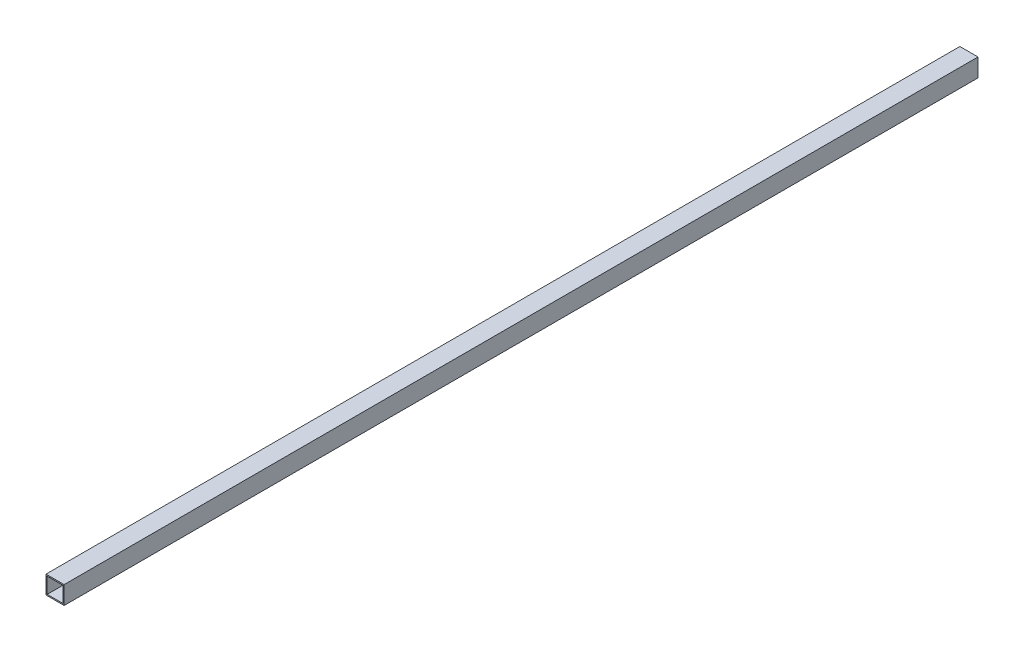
ISO-10303-21;
HEADER;
FILE_DESCRIPTION(('STEP AP214'),'2;1');
FILE_NAME('part.step','',(''),(''),'','','');
FILE_SCHEMA(('AUTOMOTIVE_DESIGN { 1 0 10303 214 1 1 1 1 }'));
ENDSEC;
DATA;
#1=APPLICATION_CONTEXT('core data for automotive mechanical design processes');
#2=APPLICATION_PROTOCOL_DEFINITION('international standard','automotive_design',2000,#1);
#3=PRODUCT_CONTEXT('',#1,'mechanical');
#4=PRODUCT('Part','Part','',(#3));
#5=PRODUCT_RELATED_PRODUCT_CATEGORY('part','',(#4));
#6=PRODUCT_DEFINITION_FORMATION('','',#4);
#7=PRODUCT_DEFINITION_CONTEXT('part definition',#1,'design');
#8=PRODUCT_DEFINITION('design','',#6,#7);
#9=PRODUCT_DEFINITION_SHAPE('','',#8);
#10=(LENGTH_UNIT() NAMED_UNIT(*) SI_UNIT(.MILLI.,.METRE.));
#11=(NAMED_UNIT(*) PLANE_ANGLE_UNIT() SI_UNIT($,.RADIAN.));
#12=(NAMED_UNIT(*) SI_UNIT($,.STERADIAN.) SOLID_ANGLE_UNIT());
#13=UNCERTAINTY_MEASURE_WITH_UNIT(LENGTH_MEASURE(1.E-05),#10,'distance_accuracy_value','');
#14=(GEOMETRIC_REPRESENTATION_CONTEXT(3) GLOBAL_UNCERTAINTY_ASSIGNED_CONTEXT((#13)) GLOBAL_UNIT_ASSIGNED_CONTEXT((#10,
#11,#12)) REPRESENTATION_CONTEXT('',''));
#15=CARTESIAN_POINT('',(0.,0.,0.));
#16=DIRECTION('',(0.,0.,1.));
#17=DIRECTION('',(1.,0.,0.));
#18=AXIS2_PLACEMENT_3D('',#15,#16,#17);
#19=CARTESIAN_POINT('',(-26.,26.,0.));
#20=DIRECTION('',(1.,0.,0.));
#21=DIRECTION('',(0.,1.,0.));
#22=AXIS2_PLACEMENT_3D('',#19,#20,#21);
#23=PLANE('',#22);
#24=DIRECTION('',(0.,-1.,0.));
#25=VECTOR('',#24,1.);
#26=CARTESIAN_POINT('',(-26.,2.5,14.));
#27=LINE('',#26,#25);
#28=CARTESIAN_POINT('',(-26.,26.,14.));
#29=VERTEX_POINT('',#28);
#30=CARTESIAN_POINT('',(-26.,-26.,14.));
#31=VERTEX_POINT('',#30);
#32=EDGE_CURVE('E113',#29,#31,#27,.T.);
#33=ORIENTED_EDGE('',*,*,#32,.F.);
#34=DIRECTION('',(0.,0.,1.));
#35=VECTOR('',#34,1.);
#36=CARTESIAN_POINT('',(-26.,26.,0.));
#37=LINE('',#36,#35);
#38=CARTESIAN_POINT('',(-26.,26.,3036.));
#39=VERTEX_POINT('',#38);
#40=EDGE_CURVE('E10',#29,#39,#37,.T.);
#41=ORIENTED_EDGE('',*,*,#40,.T.);
#42=DIRECTION('',(0.,1.,0.));
#43=VECTOR('',#42,1.);
#44=CARTESIAN_POINT('',(-26.,-33.,3036.));
#45=LINE('',#44,#43);
#46=CARTESIAN_POINT('',(-26.,-26.,3036.));
#47=VERTEX_POINT('',#46);
#48=EDGE_CURVE('E111',#47,#39,#45,.T.);
#49=ORIENTED_EDGE('',*,*,#48,.F.);
#50=DIRECTION('',(0.,0.,1.));
#51=VECTOR('',#50,1.);
#52=CARTESIAN_POINT('',(-26.,-26.,0.));
#53=LINE('',#52,#51);
#54=EDGE_CURVE('E78',#31,#47,#53,.T.);
#55=ORIENTED_EDGE('',*,*,#54,.F.);
#56=EDGE_LOOP('',(#33,#41,#49,#55));
#57=FACE_BOUND('',#56,.T.);
#58=ADVANCED_FACE('F16',(#57),#23,.T.);
#59=CARTESIAN_POINT('',(26.,26.,0.));
#60=DIRECTION('',(0.,-1.,0.));
#61=DIRECTION('',(0.,0.,-1.));
#62=AXIS2_PLACEMENT_3D('',#59,#60,#61);
#63=PLANE('',#62);
#64=DIRECTION('',(-1.,0.,0.));
#65=VECTOR('',#64,1.);
#66=CARTESIAN_POINT('',(13.,26.,14.));
#67=LINE('',#66,#65);
#68=CARTESIAN_POINT('',(26.,26.,14.));
#69=VERTEX_POINT('',#68);
#70=EDGE_CURVE('E163',#69,#29,#67,.T.);
#71=ORIENTED_EDGE('',*,*,#70,.F.);
#72=DIRECTION('',(0.,0.,1.));
#73=VECTOR('',#72,1.);
#74=CARTESIAN_POINT('',(26.,26.,0.));
#75=LINE('',#74,#73);
#76=CARTESIAN_POINT('',(26.,26.,3036.));
#77=VERTEX_POINT('',#76);
#78=EDGE_CURVE('E25',#69,#77,#75,.T.);
#79=ORIENTED_EDGE('',*,*,#78,.T.);
#80=DIRECTION('',(1.,0.,0.));
#81=VECTOR('',#80,1.);
#82=CARTESIAN_POINT('',(13.,26.,3036.));
#83=LINE('',#82,#81);
#84=EDGE_CURVE('E118',#39,#77,#83,.T.);
#85=ORIENTED_EDGE('',*,*,#84,.F.);
#86=ORIENTED_EDGE('',*,*,#40,.F.);
#87=EDGE_LOOP('',(#71,#79,#85,#86));
#88=FACE_BOUND('',#87,.T.);
#89=ADVANCED_FACE('F119',(#88),#63,.T.);
#90=CARTESIAN_POINT('',(26.,-26.,0.));
#91=DIRECTION('',(-1.,0.,0.));
#92=DIRECTION('',(0.,0.,1.));
#93=AXIS2_PLACEMENT_3D('',#90,#91,#92);
#94=PLANE('',#93);
#95=DIRECTION('',(0.,1.,0.));
#96=VECTOR('',#95,1.);
#97=CARTESIAN_POINT('',(26.,-23.5,14.));
#98=LINE('',#97,#96);
#99=CARTESIAN_POINT('',(26.,-26.,14.));
#100=VERTEX_POINT('',#99);
#101=EDGE_CURVE('E158',#100,#69,#98,.T.);
#102=ORIENTED_EDGE('',*,*,#101,.F.);
#103=DIRECTION('',(0.,0.,1.));
#104=VECTOR('',#103,1.);
#105=CARTESIAN_POINT('',(26.,-26.,0.));
#106=LINE('',#105,#104);
#107=CARTESIAN_POINT('',(26.,-26.,3036.));
#108=VERTEX_POINT('',#107);
#109=EDGE_CURVE('E38',#100,#108,#106,.T.);
#110=ORIENTED_EDGE('',*,*,#109,.T.);
#111=DIRECTION('',(0.,-1.,0.));
#112=VECTOR('',#111,1.);
#113=CARTESIAN_POINT('',(26.,-59.,3036.));
#114=LINE('',#113,#112);
#115=EDGE_CURVE('E123',#77,#108,#114,.T.);
#116=ORIENTED_EDGE('',*,*,#115,.F.);
#117=ORIENTED_EDGE('',*,*,#78,.F.);
#118=EDGE_LOOP('',(#102,#110,#116,#117));
#119=FACE_BOUND('',#118,.T.);
#120=ADVANCED_FACE('F230',(#119),#94,.T.);
#121=CARTESIAN_POINT('',(-26.,-26.,0.));
#122=DIRECTION('',(0.,1.,0.));
#123=DIRECTION('',(1.,0.,0.));
#124=AXIS2_PLACEMENT_3D('',#121,#122,#123);
#125=PLANE('',#124);
#126=DIRECTION('',(1.,0.,0.));
#127=VECTOR('',#126,1.);
#128=CARTESIAN_POINT('',(-13.,-26.,14.));
#129=LINE('',#128,#127);
#130=EDGE_CURVE('E168',#31,#100,#129,.T.);
#131=ORIENTED_EDGE('',*,*,#130,.F.);
#132=ORIENTED_EDGE('',*,*,#54,.T.);
#133=DIRECTION('',(-1.,0.,0.));
#134=VECTOR('',#133,1.);
#135=CARTESIAN_POINT('',(-13.,-26.,3036.));
#136=LINE('',#135,#134);
#137=EDGE_CURVE('E128',#108,#47,#136,.T.);
#138=ORIENTED_EDGE('',*,*,#137,.F.);
#139=ORIENTED_EDGE('',*,*,#109,.F.);
#140=EDGE_LOOP('',(#131,#132,#138,#139));
#141=FACE_BOUND('',#140,.T.);
#142=ADVANCED_FACE('F211',(#141),#125,.T.);
#143=CARTESIAN_POINT('',(30.,30.,0.));
#144=DIRECTION('',(0.,-1.,0.));
#145=DIRECTION('',(0.,0.,-1.));
#146=AXIS2_PLACEMENT_3D('',#143,#144,#145);
#147=PLANE('',#146);
#148=DIRECTION('',(0.,0.,1.));
#149=VECTOR('',#148,1.);
#150=CARTESIAN_POINT('',(-30.,30.,0.));
#151=LINE('',#150,#149);
#152=CARTESIAN_POINT('',(-30.,30.,14.));
#153=VERTEX_POINT('',#152);
#154=CARTESIAN_POINT('',(-30.,30.,3036.));
#155=VERTEX_POINT('',#154);
#156=EDGE_CURVE('E94',#153,#155,#151,.T.);
#157=ORIENTED_EDGE('',*,*,#156,.T.);
#158=DIRECTION('',(1.,0.,0.));
#159=VECTOR('',#158,1.);
#160=CARTESIAN_POINT('',(15.,30.,3036.));
#161=LINE('',#160,#159);
#162=CARTESIAN_POINT('',(30.,30.,3036.));
#163=VERTEX_POINT('',#162);
#164=EDGE_CURVE('E86',#155,#163,#161,.T.);
#165=ORIENTED_EDGE('',*,*,#164,.T.);
#166=DIRECTION('',(0.,0.,1.));
#167=VECTOR('',#166,1.);
#168=CARTESIAN_POINT('',(30.,30.,0.));
#169=LINE('',#168,#167);
#170=CARTESIAN_POINT('',(30.,30.,14.));
#171=VERTEX_POINT('',#170);
#172=EDGE_CURVE('E155',#171,#163,#169,.T.);
#173=ORIENTED_EDGE('',*,*,#172,.F.);
#174=DIRECTION('',(-1.,0.,0.));
#175=VECTOR('',#174,1.);
#176=CARTESIAN_POINT('',(15.,30.,14.));
#177=LINE('',#176,#175);
#178=EDGE_CURVE('E145',#171,#153,#177,.T.);
#179=ORIENTED_EDGE('',*,*,#178,.T.);
#180=EDGE_LOOP('',(#157,#165,#173,#179));
#181=FACE_BOUND('',#180,.T.);
#182=ADVANCED_FACE('F205',(#181),#147,.F.);
#183=CARTESIAN_POINT('',(-30.,30.,0.));
#184=DIRECTION('',(1.,0.,0.));
#185=DIRECTION('',(0.,1.,0.));
#186=AXIS2_PLACEMENT_3D('',#183,#184,#185);
#187=PLANE('',#186);
#188=DIRECTION('',(0.,0.,1.));
#189=VECTOR('',#188,1.);
#190=CARTESIAN_POINT('',(-30.,-30.,0.));
#191=LINE('',#190,#189);
#192=CARTESIAN_POINT('',(-30.,-30.,14.));
#193=VERTEX_POINT('',#192);
#194=CARTESIAN_POINT('',(-30.,-30.,3036.));
#195=VERTEX_POINT('',#194);
#196=EDGE_CURVE('E139',#193,#195,#191,.T.);
#197=ORIENTED_EDGE('',*,*,#196,.T.);
#198=DIRECTION('',(0.,1.,0.));
#199=VECTOR('',#198,1.);
#200=CARTESIAN_POINT('',(-30.,-31.,3036.));
#201=LINE('',#200,#199);
#202=EDGE_CURVE('E130',#195,#155,#201,.T.);
#203=ORIENTED_EDGE('',*,*,#202,.T.);
#204=ORIENTED_EDGE('',*,*,#156,.F.);
#205=DIRECTION('',(0.,-1.,0.));
#206=VECTOR('',#205,1.);
#207=CARTESIAN_POINT('',(-30.,4.5,14.));
#208=LINE('',#207,#206);
#209=EDGE_CURVE('E144',#153,#193,#208,.T.);
#210=ORIENTED_EDGE('',*,*,#209,.T.);
#211=EDGE_LOOP('',(#197,#203,#204,#210));
#212=FACE_BOUND('',#211,.T.);
#213=ADVANCED_FACE('F210',(#212),#187,.F.);
#214=CARTESIAN_POINT('',(0.,-92.,3036.));
#215=DIRECTION('',(0.,0.,-1.));
#216=DIRECTION('',(0.,-1.,0.));
#217=AXIS2_PLACEMENT_3D('',#214,#215,#216);
#218=PLANE('',#217);
#219=ORIENTED_EDGE('',*,*,#48,.T.);
#220=ORIENTED_EDGE('',*,*,#84,.T.);
#221=ORIENTED_EDGE('',*,*,#115,.T.);
#222=ORIENTED_EDGE('',*,*,#137,.T.);
#223=EDGE_LOOP('',(#219,#220,#221,#222));
#224=FACE_BOUND('',#223,.T.);
#225=ORIENTED_EDGE('',*,*,#164,.F.);
#226=ORIENTED_EDGE('',*,*,#202,.F.);
#227=DIRECTION('',(-1.,0.,0.));
#228=VECTOR('',#227,1.);
#229=CARTESIAN_POINT('',(-15.,-30.,3036.));
#230=LINE('',#229,#228);
#231=CARTESIAN_POINT('',(30.,-30.,3036.));
#232=VERTEX_POINT('',#231);
#233=EDGE_CURVE('E297',#232,#195,#230,.T.);
#234=ORIENTED_EDGE('',*,*,#233,.F.);
#235=DIRECTION('',(0.,-1.,0.));
#236=VECTOR('',#235,1.);
#237=CARTESIAN_POINT('',(30.,-61.,3036.));
#238=LINE('',#237,#236);
#239=EDGE_CURVE('E152',#163,#232,#238,.T.);
#240=ORIENTED_EDGE('',*,*,#239,.F.);
#241=EDGE_LOOP('',(#225,#226,#234,#240));
#242=FACE_BOUND('',#241,.T.);
#243=ADVANCED_FACE('F126',(#224,#242),#218,.F.);
#244=CARTESIAN_POINT('',(30.,-30.,0.));
#245=DIRECTION('',(-1.,0.,0.));
#246=DIRECTION('',(0.,0.,1.));
#247=AXIS2_PLACEMENT_3D('',#244,#245,#246);
#248=PLANE('',#247);
#249=ORIENTED_EDGE('',*,*,#172,.T.);
#250=ORIENTED_EDGE('',*,*,#239,.T.);
#251=DIRECTION('',(0.,0.,1.));
#252=VECTOR('',#251,1.);
#253=CARTESIAN_POINT('',(30.,-30.,0.));
#254=LINE('',#253,#252);
#255=CARTESIAN_POINT('',(30.,-30.,14.));
#256=VERTEX_POINT('',#255);
#257=EDGE_CURVE('E293',#256,#232,#254,.T.);
#258=ORIENTED_EDGE('',*,*,#257,.F.);
#259=DIRECTION('',(0.,1.,0.));
#260=VECTOR('',#259,1.);
#261=CARTESIAN_POINT('',(30.,-25.5,14.));
#262=LINE('',#261,#260);
#263=EDGE_CURVE('E141',#256,#171,#262,.T.);
#264=ORIENTED_EDGE('',*,*,#263,.T.);
#265=EDGE_LOOP('',(#249,#250,#258,#264));
#266=FACE_BOUND('',#265,.T.);
#267=ADVANCED_FACE('F220',(#266),#248,.F.);
#268=CARTESIAN_POINT('',(0.,-21.,14.));
#269=DIRECTION('',(0.,0.,1.));
#270=DIRECTION('',(1.,0.,0.));
#271=AXIS2_PLACEMENT_3D('',#268,#269,#270);
#272=PLANE('',#271);
#273=ORIENTED_EDGE('',*,*,#101,.T.);
#274=ORIENTED_EDGE('',*,*,#70,.T.);
#275=ORIENTED_EDGE('',*,*,#32,.T.);
#276=ORIENTED_EDGE('',*,*,#130,.T.);
#277=EDGE_LOOP('',(#273,#274,#275,#276));
#278=FACE_BOUND('',#277,.T.);
#279=ORIENTED_EDGE('',*,*,#178,.F.);
#280=ORIENTED_EDGE('',*,*,#263,.F.);
#281=DIRECTION('',(1.,0.,0.));
#282=VECTOR('',#281,1.);
#283=CARTESIAN_POINT('',(-15.,-30.,14.));
#284=LINE('',#283,#282);
#285=EDGE_CURVE('E146',#193,#256,#284,.T.);
#286=ORIENTED_EDGE('',*,*,#285,.F.);
#287=ORIENTED_EDGE('',*,*,#209,.F.);
#288=EDGE_LOOP('',(#279,#280,#286,#287));
#289=FACE_BOUND('',#288,.T.);
#290=ADVANCED_FACE('F198',(#278,#289),#272,.F.);
#291=CARTESIAN_POINT('',(-30.,-30.,0.));
#292=DIRECTION('',(0.,1.,0.));
#293=DIRECTION('',(1.,0.,0.));
#294=AXIS2_PLACEMENT_3D('',#291,#292,#293);
#295=PLANE('',#294);
#296=ORIENTED_EDGE('',*,*,#257,.T.);
#297=ORIENTED_EDGE('',*,*,#233,.T.);
#298=ORIENTED_EDGE('',*,*,#196,.F.);
#299=ORIENTED_EDGE('',*,*,#285,.T.);
#300=EDGE_LOOP('',(#296,#297,#298,#299));
#301=FACE_BOUND('',#300,.T.);
#302=ADVANCED_FACE('F193',(#301),#295,.F.);
#303=CLOSED_SHELL('',(#58,#89,#120,#142,#182,#213,#243,#267,#290,#302));
#304=MANIFOLD_SOLID_BREP('B1',#303);
#305=ADVANCED_BREP_SHAPE_REPRESENTATION('',(#18,#304),#14);
#306=SHAPE_DEFINITION_REPRESENTATION(#9,#305);
ENDSEC;
END-ISO-10303-21;
